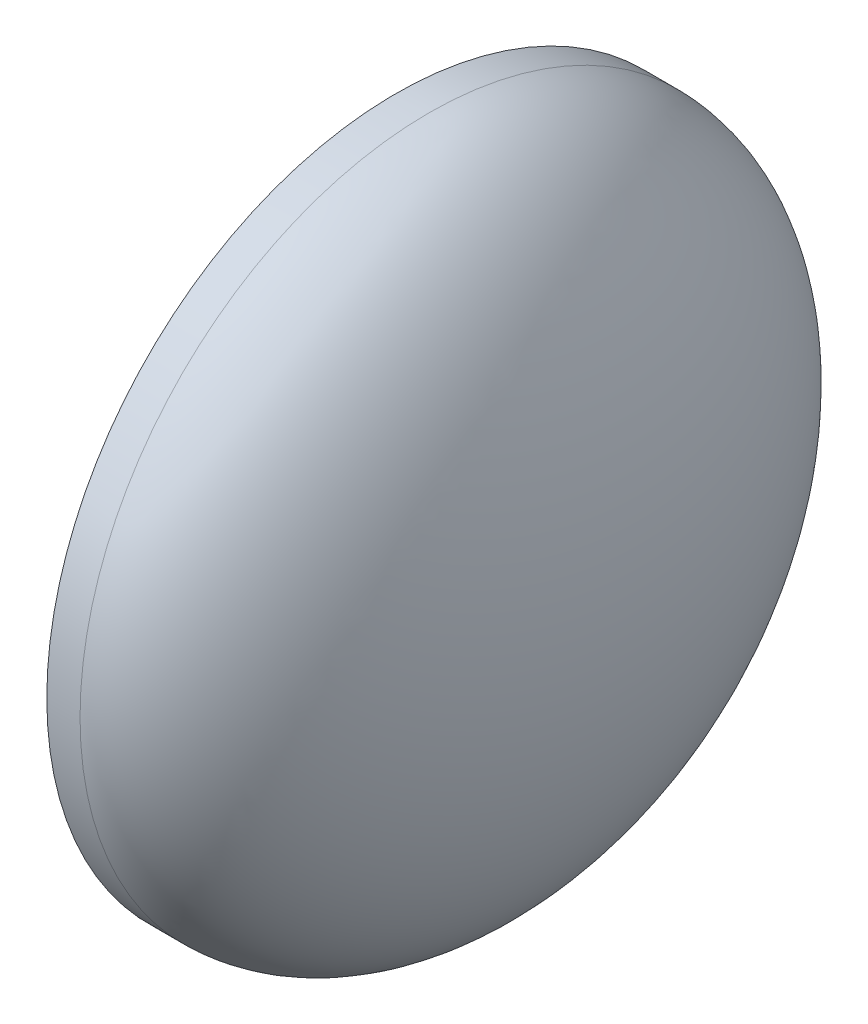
ISO-10303-21;
HEADER;
FILE_DESCRIPTION(('STEP AP214'),'2;1');
FILE_NAME('part.step','',(''),(''),'','','');
FILE_SCHEMA(('AUTOMOTIVE_DESIGN { 1 0 10303 214 1 1 1 1 }'));
ENDSEC;
DATA;
#1=APPLICATION_CONTEXT('core data for automotive mechanical design processes');
#2=APPLICATION_PROTOCOL_DEFINITION('international standard','automotive_design',2000,#1);
#3=PRODUCT_CONTEXT('',#1,'mechanical');
#4=PRODUCT('Part','Part','',(#3));
#5=PRODUCT_RELATED_PRODUCT_CATEGORY('part','',(#4));
#6=PRODUCT_DEFINITION_FORMATION('','',#4);
#7=PRODUCT_DEFINITION_CONTEXT('part definition',#1,'design');
#8=PRODUCT_DEFINITION('design','',#6,#7);
#9=PRODUCT_DEFINITION_SHAPE('','',#8);
#10=(LENGTH_UNIT() NAMED_UNIT(*) SI_UNIT(.MILLI.,.METRE.));
#11=(NAMED_UNIT(*) PLANE_ANGLE_UNIT() SI_UNIT($,.RADIAN.));
#12=(NAMED_UNIT(*) SI_UNIT($,.STERADIAN.) SOLID_ANGLE_UNIT());
#13=UNCERTAINTY_MEASURE_WITH_UNIT(LENGTH_MEASURE(1.E-05),#10,'distance_accuracy_value','');
#14=(GEOMETRIC_REPRESENTATION_CONTEXT(3) GLOBAL_UNCERTAINTY_ASSIGNED_CONTEXT((#13)) GLOBAL_UNIT_ASSIGNED_CONTEXT((#10,
#11,#12)) REPRESENTATION_CONTEXT('',''));
#15=CARTESIAN_POINT('',(0.,0.,0.));
#16=DIRECTION('',(0.,0.,1.));
#17=DIRECTION('',(1.,0.,0.));
#18=AXIS2_PLACEMENT_3D('',#15,#16,#17);
#19=CARTESIAN_POINT('',(1828.8,0.,0.));
#20=DIRECTION('',(-1.,0.,0.));
#21=DIRECTION('',(0.,0.,1.));
#22=AXIS2_PLACEMENT_3D('',#19,#20,#21);
#23=CYLINDRICAL_SURFACE('',#22,533.4);
#24=CARTESIAN_POINT('',(1828.8,0.,0.));
#25=DIRECTION('',(-1.,0.,0.));
#26=DIRECTION('',(0.,0.,1.));
#27=AXIS2_PLACEMENT_3D('',#24,#25,#26);
#28=CIRCLE('',#27,533.4);
#29=CARTESIAN_POINT('',(1828.8,0.,533.4));
#30=VERTEX_POINT('',#29);
#31=EDGE_CURVE('E11',#30,#30,#28,.T.);
#32=ORIENTED_EDGE('',*,*,#31,.F.);
#33=EDGE_LOOP('',(#32));
#34=FACE_BOUND('',#33,.T.);
#35=CARTESIAN_POINT('',(1879.6,0.,0.));
#36=DIRECTION('',(-1.,0.,0.));
#37=DIRECTION('',(0.,0.,1.));
#38=AXIS2_PLACEMENT_3D('',#35,#36,#37);
#39=CIRCLE('',#38,533.4);
#40=CARTESIAN_POINT('',(1879.6,0.,533.4));
#41=VERTEX_POINT('',#40);
#42=EDGE_CURVE('E57',#41,#41,#39,.T.);
#43=ORIENTED_EDGE('',*,*,#42,.T.);
#44=EDGE_LOOP('',(#43));
#45=FACE_BOUND('',#44,.T.);
#46=ADVANCED_FACE('F34',(#34,#45),#23,.T.);
#47=CARTESIAN_POINT('',(1828.8,533.4,0.));
#48=DIRECTION('',(1.,0.,0.));
#49=DIRECTION('',(0.,0.,-1.));
#50=AXIS2_PLACEMENT_3D('',#47,#48,#49);
#51=PLANE('',#50);
#52=CARTESIAN_POINT('',(1828.8,0.,0.));
#53=DIRECTION('',(-1.,0.,0.));
#54=DIRECTION('',(0.,0.,1.));
#55=AXIS2_PLACEMENT_3D('',#52,#53,#54);
#56=CIRCLE('',#55,520.7);
#57=CARTESIAN_POINT('',(1828.8,0.,520.7));
#58=VERTEX_POINT('',#57);
#59=EDGE_CURVE('E41',#58,#58,#56,.T.);
#60=ORIENTED_EDGE('',*,*,#59,.F.);
#61=EDGE_LOOP('',(#60));
#62=FACE_BOUND('',#61,.T.);
#63=ORIENTED_EDGE('',*,*,#31,.T.);
#64=EDGE_LOOP('',(#63));
#65=FACE_BOUND('',#64,.T.);
#66=ADVANCED_FACE('F73',(#62,#65),#51,.F.);
#67=CARTESIAN_POINT('',(1828.8,0.,0.));
#68=DIRECTION('',(-1.,0.,0.));
#69=DIRECTION('',(0.,0.,1.));
#70=AXIS2_PLACEMENT_3D('',#67,#68,#69);
#71=CYLINDRICAL_SURFACE('',#70,520.7);
#72=CARTESIAN_POINT('',(1879.6,0.,0.));
#73=DIRECTION('',(-1.,0.,0.));
#74=DIRECTION('',(0.,0.,1.));
#75=AXIS2_PLACEMENT_3D('',#72,#73,#74);
#76=CIRCLE('',#75,520.7);
#77=CARTESIAN_POINT('',(1879.6,0.,520.7));
#78=VERTEX_POINT('',#77);
#79=EDGE_CURVE('E55',#78,#78,#76,.T.);
#80=ORIENTED_EDGE('',*,*,#79,.F.);
#81=EDGE_LOOP('',(#80));
#82=FACE_BOUND('',#81,.T.);
#83=ORIENTED_EDGE('',*,*,#59,.T.);
#84=EDGE_LOOP('',(#83));
#85=FACE_BOUND('',#84,.T.);
#86=ADVANCED_FACE('F51',(#82,#85),#71,.F.);
#87=CARTESIAN_POINT('',(1879.6,520.7,0.));
#88=CARTESIAN_POINT('',(1883.66623570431,520.7,0.));
#89=CARTESIAN_POINT('',(1891.78356429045,520.31063410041,0.));
#90=CARTESIAN_POINT('',(1908.0273048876,517.971460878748,0.));
#91=CARTESIAN_POINT('',(1928.29772991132,512.107717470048,0.));
#92=CARTESIAN_POINT('',(1952.45342018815,500.303799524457,0.));
#93=CARTESIAN_POINT('',(1984.13611353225,478.184705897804,0.));
#94=CARTESIAN_POINT('',(2022.05371008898,438.687396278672,0.));
#95=CARTESIAN_POINT('',(2062.53449917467,373.859954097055,0.));
#96=CARTESIAN_POINT('',(2096.03203902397,294.17519134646,0.));
#97=CARTESIAN_POINT('',(2116.86780519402,218.05021404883,0.));
#98=CARTESIAN_POINT('',(2128.75611150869,153.141666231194,0.));
#99=CARTESIAN_POINT('',(2135.19345334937,102.944784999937,0.));
#100=CARTESIAN_POINT('',(2138.43439355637,60.2634395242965,0.));
#101=CARTESIAN_POINT('',(2139.73330269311,25.8653825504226,0.));
#102=CARTESIAN_POINT('',(2139.95,8.61848556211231,0.));
#103=CARTESIAN_POINT('',(2139.95,0.,0.));
#104=B_SPLINE_CURVE_WITH_KNOTS('',3,(#87,#88,#89,#90,#91,#92,#93,#94,#95,#96,#97,#98,#99,#100,
#101,#102,#103),.UNSPECIFIED.,.F.,.F.,(4,1,1,1,1,1,1,1,1,1,1,1,1,1,4),(-1.5707963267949,
-1.52170894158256,-1.47262155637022,-1.37444678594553,-1.27627201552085,-1.17809724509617,
-0.981747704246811,-0.785398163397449,-0.589048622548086,-0.392699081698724,-0.294524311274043,
-0.196349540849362,-0.0981747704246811,-0.0490873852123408,0.),.UNSPECIFIED.);
#105=CARTESIAN_POINT('',(1828.8,0.,0.));
#106=DIRECTION('',(-1.,0.,0.));
#107=AXIS1_PLACEMENT('',#105,#106);
#108=SURFACE_OF_REVOLUTION('',#104,#107);
#109=CARTESIAN_POINT('',(2139.95,0.,0.));
#110=VERTEX_POINT('',#109);
#111=VERTEX_LOOP('',#110);
#112=FACE_BOUND('',#111,.T.);
#113=ORIENTED_EDGE('',*,*,#79,.T.);
#114=EDGE_LOOP('',(#113));
#115=FACE_BOUND('',#114,.T.);
#116=ADVANCED_FACE('F47',(#112,#115),#108,.T.);
#117=CARTESIAN_POINT('',(1879.6,0.,0.));
#118=DIRECTION('',(0.,0.,1.));
#119=DIRECTION('',(0.,1.,0.));
#120=AXIS2_PLACEMENT_3D('',#117,#118,#119);
#121=ELLIPSE('',#120,533.4,273.05);
#122=TRIMMED_CURVE('',#121,(PARAMETER_VALUE(4.71238898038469)),
(PARAMETER_VALUE(7.85398163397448)),.T.,.PARAMETER.);
#123=CARTESIAN_POINT('',(1828.8,0.,0.));
#124=DIRECTION('',(-1.,0.,0.));
#125=AXIS1_PLACEMENT('',#123,#124);
#126=SURFACE_OF_REVOLUTION('',#122,#125);
#127=ORIENTED_EDGE('',*,*,#42,.F.);
#128=EDGE_LOOP('',(#127));
#129=FACE_BOUND('',#128,.T.);
#130=CARTESIAN_POINT('',(2152.65,0.,0.));
#131=VERTEX_POINT('',#130);
#132=VERTEX_LOOP('',#131);
#133=FACE_BOUND('',#132,.T.);
#134=ADVANCED_FACE('F50',(#129,#133),#126,.T.);
#135=CLOSED_SHELL('',(#46,#66,#86,#116,#134));
#136=MANIFOLD_SOLID_BREP('B2',#135);
#137=ADVANCED_BREP_SHAPE_REPRESENTATION('',(#18,#136),#14);
#138=SHAPE_DEFINITION_REPRESENTATION(#9,#137);
ENDSEC;
END-ISO-10303-21;
